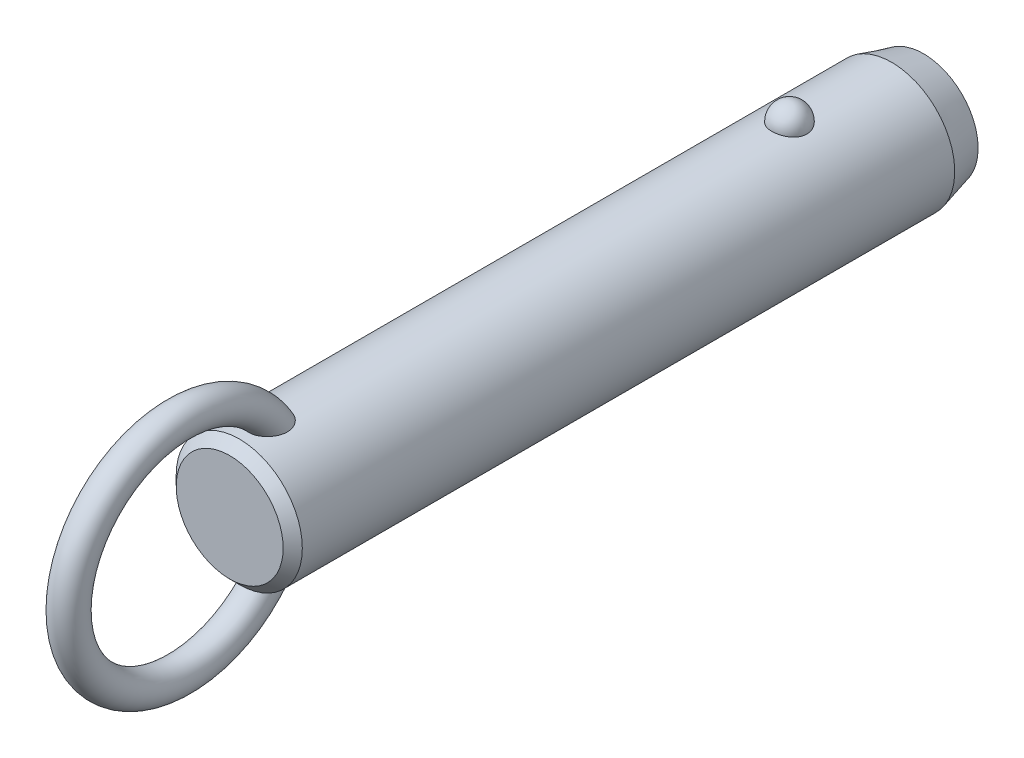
ISO-10303-21;
HEADER;
FILE_DESCRIPTION(('STEP AP214'),'2;1');
FILE_NAME('part.step','',(''),(''),'','','');
FILE_SCHEMA(('AUTOMOTIVE_DESIGN { 1 0 10303 214 1 1 1 1 }'));
ENDSEC;
DATA;
#1=APPLICATION_CONTEXT('core data for automotive mechanical design processes');
#2=APPLICATION_PROTOCOL_DEFINITION('international standard','automotive_design',2000,#1);
#3=PRODUCT_CONTEXT('',#1,'mechanical');
#4=PRODUCT('Part','Part','',(#3));
#5=PRODUCT_RELATED_PRODUCT_CATEGORY('part','',(#4));
#6=PRODUCT_DEFINITION_FORMATION('','',#4);
#7=PRODUCT_DEFINITION_CONTEXT('part definition',#1,'design');
#8=PRODUCT_DEFINITION('design','',#6,#7);
#9=PRODUCT_DEFINITION_SHAPE('','',#8);
#10=(LENGTH_UNIT() NAMED_UNIT(*) SI_UNIT(.MILLI.,.METRE.));
#11=(NAMED_UNIT(*) PLANE_ANGLE_UNIT() SI_UNIT($,.RADIAN.));
#12=(NAMED_UNIT(*) SI_UNIT($,.STERADIAN.) SOLID_ANGLE_UNIT());
#13=UNCERTAINTY_MEASURE_WITH_UNIT(LENGTH_MEASURE(1.E-05),#10,'distance_accuracy_value','');
#14=(GEOMETRIC_REPRESENTATION_CONTEXT(3) GLOBAL_UNCERTAINTY_ASSIGNED_CONTEXT((#13)) GLOBAL_UNIT_ASSIGNED_CONTEXT((#10,
#11,#12)) REPRESENTATION_CONTEXT('',''));
#15=CARTESIAN_POINT('',(0.,0.,0.));
#16=DIRECTION('',(0.,0.,1.));
#17=DIRECTION('',(1.,0.,0.));
#18=AXIS2_PLACEMENT_3D('',#15,#16,#17);
#19=CARTESIAN_POINT('',(0.,0.,58.4));
#20=DIRECTION('',(0.,0.,-1.));
#21=DIRECTION('',(-1.,0.,0.));
#22=AXIS2_PLACEMENT_3D('',#19,#20,#21);
#23=CYLINDRICAL_SURFACE('',#22,7.9);
#24=CARTESIAN_POINT('',(2.1785689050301,7.59367088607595,-2.19999999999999));
#25=CARTESIAN_POINT('',(2.17856679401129,7.59367269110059,-2.07701843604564));
#26=CARTESIAN_POINT('',(2.16853481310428,7.59657145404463,-1.95401006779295));
#27=CARTESIAN_POINT('',(2.12864689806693,7.607843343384,-1.71147811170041));
#28=CARTESIAN_POINT('',(2.09878338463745,7.61621856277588,-1.59195587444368));
#29=CARTESIAN_POINT('',(2.0199931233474,7.63749180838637,-1.3598563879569));
#30=CARTESIAN_POINT('',(1.97107475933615,7.6503878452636,-1.24727610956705));
#31=CARTESIAN_POINT('',(1.85539377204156,7.67926115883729,-1.03213234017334));
#32=CARTESIAN_POINT('',(1.78863158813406,7.69523835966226,-0.929568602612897));
#33=CARTESIAN_POINT('',(1.63856494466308,7.7285848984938,-0.736786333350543));
#34=CARTESIAN_POINT('',(1.55518140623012,7.7459606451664,-0.646630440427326));
#35=CARTESIAN_POINT('',(1.37422937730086,7.78009978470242,-0.481747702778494));
#36=CARTESIAN_POINT('',(1.27666086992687,7.79686317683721,-0.407020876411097));
#37=CARTESIAN_POINT('',(1.07024728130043,7.82786153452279,-0.275278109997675));
#38=CARTESIAN_POINT('',(0.961434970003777,7.84210353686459,-0.218212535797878));
#39=CARTESIAN_POINT('',(0.735351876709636,7.86652194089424,-0.123146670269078));
#40=CARTESIAN_POINT('',(0.618082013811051,7.87669878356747,-0.085144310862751));
#41=CARTESIAN_POINT('',(0.380637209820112,7.89170521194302,-0.0298158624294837));
#42=CARTESIAN_POINT('',(0.260550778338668,7.89662650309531,-0.0121347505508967));
#43=CARTESIAN_POINT('',(0.0190117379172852,7.90090003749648,0.00324379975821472));
#44=CARTESIAN_POINT('',(-0.102440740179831,7.90025280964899,0.00094313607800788));
#45=CARTESIAN_POINT('',(-0.341452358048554,7.89351056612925,-0.0233955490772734));
#46=CARTESIAN_POINT('',(-0.459042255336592,7.88749257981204,-0.0451545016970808));
#47=CARTESIAN_POINT('',(-0.688796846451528,7.87075812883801,-0.107408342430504));
#48=CARTESIAN_POINT('',(-0.800961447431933,7.86004158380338,-0.147903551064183));
#49=CARTESIAN_POINT('',(-1.01743634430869,7.83497131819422,-0.246799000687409));
#50=CARTESIAN_POINT('',(-1.12169791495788,7.82059709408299,-0.305300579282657));
#51=CARTESIAN_POINT('',(-1.31891765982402,7.78976470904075,-0.438549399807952));
#52=CARTESIAN_POINT('',(-1.41187469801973,7.77330633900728,-0.513298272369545));
#53=CARTESIAN_POINT('',(-1.58577142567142,7.73972434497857,-0.678622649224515));
#54=CARTESIAN_POINT('',(-1.66645140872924,7.72259402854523,-0.769470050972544));
#55=CARTESIAN_POINT('',(-1.81161503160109,7.68983776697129,-0.963538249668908));
#56=CARTESIAN_POINT('',(-1.87609753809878,7.6742119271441,-1.06675991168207));
#57=CARTESIAN_POINT('',(-1.98790138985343,7.6460202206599,-1.28401170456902));
#58=CARTESIAN_POINT('',(-2.03501994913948,7.63349104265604,-1.39815107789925));
#59=CARTESIAN_POINT('',(-2.10986724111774,7.6131449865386,-1.63301784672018));
#60=CARTESIAN_POINT('',(-2.1375965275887,7.60532797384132,-1.75374505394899));
#61=CARTESIAN_POINT('',(-2.17289256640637,7.5953195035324,-1.99782562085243));
#62=CARTESIAN_POINT('',(-2.18054294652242,7.59310471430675,-2.12116592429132));
#63=CARTESIAN_POINT('',(-2.17572919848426,7.59448538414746,-2.36741799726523));
#64=CARTESIAN_POINT('',(-2.1632656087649,7.59808068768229,-2.49032977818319));
#65=CARTESIAN_POINT('',(-2.11865035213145,7.61064035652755,-2.73161015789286));
#66=CARTESIAN_POINT('',(-2.08659579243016,7.61957823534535,-2.84999812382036));
#67=CARTESIAN_POINT('',(-2.00367799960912,7.64179982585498,-3.07955956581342));
#68=CARTESIAN_POINT('',(-1.9528140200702,7.65508371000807,-3.19073275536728));
#69=CARTESIAN_POINT('',(-1.83321113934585,7.68460381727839,-3.40337899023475));
#70=CARTESIAN_POINT('',(-1.76437735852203,7.70085556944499,-3.50479651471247));
#71=CARTESIAN_POINT('',(-1.61069526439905,7.73445734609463,-3.69446912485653));
#72=CARTESIAN_POINT('',(-1.52584634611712,7.75180741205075,-3.78272371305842));
#73=CARTESIAN_POINT('',(-1.34198059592,7.78574608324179,-3.94393987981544));
#74=CARTESIAN_POINT('',(-1.24291308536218,7.80233167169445,-4.01684434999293));
#75=CARTESIAN_POINT('',(-1.03352039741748,7.83281625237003,-4.14489386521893));
#76=CARTESIAN_POINT('',(-0.92319600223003,7.84671543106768,-4.20004014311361));
#77=CARTESIAN_POINT('',(-0.695822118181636,7.87011575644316,-4.29042017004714));
#78=CARTESIAN_POINT('',(-0.578872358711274,7.87966903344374,-4.32589112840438));
#79=CARTESIAN_POINT('',(-0.340410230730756,7.8935652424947,-4.37692226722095));
#80=CARTESIAN_POINT('',(-0.218898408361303,7.89790879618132,-4.39248482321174));
#81=CARTESIAN_POINT('',(0.0228107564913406,7.90087453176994,-4.40314405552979));
#82=CARTESIAN_POINT('',(0.142990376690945,7.89960185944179,-4.39861683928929));
#83=CARTESIAN_POINT('',(0.380829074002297,7.89171262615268,-4.37008293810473));
#84=CARTESIAN_POINT('',(0.498488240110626,7.8850962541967,-4.34607694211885));
#85=CARTESIAN_POINT('',(0.727535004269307,7.86726442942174,-4.27939317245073));
#86=CARTESIAN_POINT('',(0.838944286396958,7.85606616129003,-4.236785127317));
#87=CARTESIAN_POINT('',(1.05295421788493,7.83025654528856,-4.13408348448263));
#88=CARTESIAN_POINT('',(1.15555431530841,7.81564498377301,-4.07398879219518));
#89=CARTESIAN_POINT('',(1.35076763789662,7.7843022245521,-3.93687432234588));
#90=CARTESIAN_POINT('',(1.4432046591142,7.76754209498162,-3.85961036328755));
#91=CARTESIAN_POINT('',(1.6139111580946,7.73387857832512,-3.69076949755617));
#92=CARTESIAN_POINT('',(1.6921781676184,7.71697516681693,-3.59919010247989));
#93=CARTESIAN_POINT('',(1.83380875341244,7.6845643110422,-3.40247278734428));
#94=CARTESIAN_POINT('',(1.89689280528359,7.66908588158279,-3.29712873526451));
#95=CARTESIAN_POINT('',(2.0047823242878,7.64159441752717,-3.07707931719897));
#96=CARTESIAN_POINT('',(2.0495945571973,7.62958010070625,-2.96237743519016));
#97=CARTESIAN_POINT('',(2.11580183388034,7.61146617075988,-2.74040519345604));
#98=CARTESIAN_POINT('',(2.13929812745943,7.60484503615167,-2.63379846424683));
#99=CARTESIAN_POINT('',(2.17068242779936,7.59594664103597,-2.41813481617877));
#100=CARTESIAN_POINT('',(2.17857077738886,7.59366928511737,-2.30907795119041));
#101=CARTESIAN_POINT('',(2.1785689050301,7.59367088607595,-2.19999999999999));
#102=B_SPLINE_CURVE_WITH_KNOTS('',3,(#24,#25,#26,#27,#28,#29,#30,#31,#32,#33,#34,#35,#36,#37,
#38,#39,#40,#41,#42,#43,#44,#45,#46,#47,#48,#49,#50,#51,#52,#53,#54,#55,#56,#57,#58,#59,#60,#61,
#62,#63,#64,#65,#66,#67,#68,#69,#70,#71,#72,#73,#74,#75,#76,#77,#78,#79,#80,#81,#82,#83,#84,#85,
#86,#87,#88,#89,#90,#91,#92,#93,#94,#95,#96,#97,#98,#99,#100,#101),.UNSPECIFIED.,.T.,.F.,(4,2,2,
2,2,2,2,2,2,2,2,2,2,2,2,2,2,2,2,2,2,2,2,2,2,2,2,2,2,2,2,2,2,2,2,2,2,2,4),(0.,0.368552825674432,
0.737246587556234,1.10577831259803,1.4743009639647,1.8446206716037,2.21494081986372,
2.5842105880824,2.95344028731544,3.31611630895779,3.67875788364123,4.03628044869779,
4.39380913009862,4.75338791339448,5.11300280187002,5.47939989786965,5.8458226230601,
6.21639834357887,6.58696347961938,6.95598276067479,7.32499216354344,7.69218715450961,
8.0593967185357,8.42858578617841,8.79778880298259,9.16834203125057,9.5388695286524,
9.90482699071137,10.2707407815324,10.6298333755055,10.9889132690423,11.3466585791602,
11.7044262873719,12.0676511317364,12.4309391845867,12.8004764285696,13.1698767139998,
13.4967701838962,13.8236564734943),.UNSPECIFIED.);
#103=CARTESIAN_POINT('',(2.1785689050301,7.59367088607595,-2.19999999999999));
#104=VERTEX_POINT('',#103);
#105=EDGE_CURVE('E41',#104,#104,#102,.T.);
#106=ORIENTED_EDGE('',*,*,#105,.T.);
#107=EDGE_LOOP('',(#106));
#108=FACE_BOUND('',#107,.T.);
#109=CARTESIAN_POINT('',(0.,0.,66.72));
#110=DIRECTION('',(0.,0.,1.));
#111=DIRECTION('',(1.,0.,0.));
#112=AXIS2_PLACEMENT_3D('',#109,#110,#111);
#113=CIRCLE('',#112,7.9);
#114=CARTESIAN_POINT('',(7.9,0.,66.72));
#115=VERTEX_POINT('',#114);
#116=EDGE_CURVE('E10',#115,#115,#113,.F.);
#117=ORIENTED_EDGE('',*,*,#116,.T.);
#118=EDGE_LOOP('',(#117));
#119=FACE_BOUND('',#118,.T.);
#120=CARTESIAN_POINT('',(-0.63096985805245,-7.87476203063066,60.6124322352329));
#121=CARTESIAN_POINT('',(-0.734180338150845,-7.8664899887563,60.647285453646));
#122=CARTESIAN_POINT('',(-0.834476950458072,-7.85639291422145,60.6908160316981));
#123=CARTESIAN_POINT('',(-1.0262035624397,-7.83366343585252,60.7940948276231));
#124=CARTESIAN_POINT('',(-1.1176141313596,-7.82102565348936,60.8538775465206));
#125=CARTESIAN_POINT('',(-1.28877277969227,-7.79464922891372,60.9878390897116));
#126=CARTESIAN_POINT('',(-1.36854014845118,-7.78091246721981,61.061993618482));
#127=CARTESIAN_POINT('',(-1.5146152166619,-7.75380398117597,61.2224941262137));
#128=CARTESIAN_POINT('',(-1.58092966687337,-7.74043207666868,61.3088339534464));
#129=CARTESIAN_POINT('',(-1.70019064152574,-7.71512522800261,61.4929784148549));
#130=CARTESIAN_POINT('',(-1.75284037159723,-7.70322473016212,61.5909792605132));
#131=CARTESIAN_POINT('',(-1.84263464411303,-7.68224112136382,61.7941029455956));
#132=CARTESIAN_POINT('',(-1.87977299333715,-7.6731591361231,61.8992286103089));
#133=CARTESIAN_POINT('',(-1.94152728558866,-7.65777930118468,62.1232849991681));
#134=CARTESIAN_POINT('',(-1.96475471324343,-7.65179654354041,62.2426167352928));
#135=CARTESIAN_POINT('',(-1.99449499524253,-7.64409642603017,62.4834298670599));
#136=CARTESIAN_POINT('',(-2.0010005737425,-7.64238092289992,62.6049121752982));
#137=CARTESIAN_POINT('',(-1.99856014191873,-7.64302120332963,62.8683409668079));
#138=CARTESIAN_POINT('',(-1.98680021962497,-7.64611845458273,63.0102565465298));
#139=CARTESIAN_POINT('',(-1.94457772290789,-7.65696186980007,63.2911188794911));
#140=CARTESIAN_POINT('',(-1.91409393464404,-7.66471330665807,63.4300620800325));
#141=CARTESIAN_POINT('',(-1.82768670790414,-7.68582947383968,63.7319397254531));
#142=CARTESIAN_POINT('',(-1.76772963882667,-7.70003779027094,63.893686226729));
#143=CARTESIAN_POINT('',(-1.65998501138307,-7.72371550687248,64.1276956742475));
#144=CARTESIAN_POINT('',(-1.621079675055,-7.73200670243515,64.2042974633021));
#145=CARTESIAN_POINT('',(-1.53727726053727,-7.74910377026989,64.3540798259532));
#146=CARTESIAN_POINT('',(-1.49238215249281,-7.75790947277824,64.4272615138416));
#147=CARTESIAN_POINT('',(-1.3739705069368,-7.77993338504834,64.6028838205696));
#148=CARTESIAN_POINT('',(-1.29690364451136,-7.79328473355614,64.7029557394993));
#149=CARTESIAN_POINT('',(-1.1288548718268,-7.81939266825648,64.8907147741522));
#150=CARTESIAN_POINT('',(-1.0378992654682,-7.83215032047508,64.9784247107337));
#151=CARTESIAN_POINT('',(-0.86953281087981,-7.85231710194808,65.1134148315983));
#152=CARTESIAN_POINT('',(-0.795716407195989,-7.86021093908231,65.165076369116));
#153=CARTESIAN_POINT('',(-0.640813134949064,-7.87434920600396,65.2563815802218));
#154=CARTESIAN_POINT('',(-0.559737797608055,-7.88059619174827,65.2960438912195));
#155=CARTESIAN_POINT('',(-0.406456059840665,-7.88984116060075,65.3543008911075));
#156=CARTESIAN_POINT('',(-0.3352279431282,-7.89321892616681,65.3753848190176));
#157=CARTESIAN_POINT('',(-0.190193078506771,-7.89804235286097,65.4054141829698));
#158=CARTESIAN_POINT('',(-0.116388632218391,-7.89948969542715,65.4143701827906));
#159=CARTESIAN_POINT('',(0.0318414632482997,-7.90028409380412,65.4192915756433));
#160=CARTESIAN_POINT('',(0.106268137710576,-7.89962640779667,65.4152276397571));
#161=CARTESIAN_POINT('',(0.253290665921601,-7.8962818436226,65.3944615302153));
#162=CARTESIAN_POINT('',(0.32588518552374,-7.8935935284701,65.3777504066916));
#163=CARTESIAN_POINT('',(0.481441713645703,-7.88577340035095,65.3287380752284));
#164=CARTESIAN_POINT('',(0.563611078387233,-7.88026321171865,65.294005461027));
#165=CARTESIAN_POINT('',(0.721129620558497,-7.86741729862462,65.2117965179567));
#166=CARTESIAN_POINT('',(0.796466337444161,-7.86007832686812,65.1642975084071));
#167=CARTESIAN_POINT('',(0.971456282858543,-7.84073285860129,65.036513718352));
#168=CARTESIAN_POINT('',(1.06719686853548,-7.82809461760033,64.9510047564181));
#169=CARTESIAN_POINT('',(1.24418921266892,-7.80192439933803,64.766232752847));
#170=CARTESIAN_POINT('',(1.32540832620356,-7.78839049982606,64.6669395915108));
#171=CARTESIAN_POINT('',(1.45199971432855,-7.76559693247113,64.4895760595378));
#172=CARTESIAN_POINT('',(1.50085649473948,-7.75626094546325,64.4139542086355));
#173=CARTESIAN_POINT('',(1.59197749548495,-7.73807279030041,64.2587428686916));
#174=CARTESIAN_POINT('',(1.63423919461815,-7.72922080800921,64.179151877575));
#175=CARTESIAN_POINT('',(1.7122261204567,-7.71231959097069,64.0166640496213));
#176=CARTESIAN_POINT('',(1.74794516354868,-7.70427111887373,63.933764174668));
#177=CARTESIAN_POINT('',(1.81270113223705,-7.68929240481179,63.7652967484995));
#178=CARTESIAN_POINT('',(1.84173789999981,-7.68236218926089,63.6797291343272));
#179=CARTESIAN_POINT('',(1.89322698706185,-7.6698375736,63.5052870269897));
#180=CARTESIAN_POINT('',(1.91558744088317,-7.66426199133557,63.4163838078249));
#181=CARTESIAN_POINT('',(1.9528136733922,-7.65485915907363,63.2369696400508));
#182=CARTESIAN_POINT('',(1.96767946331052,-7.65103190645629,63.1464586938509));
#183=CARTESIAN_POINT('',(2.0002145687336,-7.64262981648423,62.8737320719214));
#184=CARTESIAN_POINT('',(2.00600691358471,-7.6410871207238,62.6897099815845));
#185=CARTESIAN_POINT('',(1.98445334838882,-7.64669564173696,62.3765019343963));
#186=CARTESIAN_POINT('',(1.96607186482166,-7.65149688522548,62.246618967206));
#187=CARTESIAN_POINT('',(1.90884967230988,-7.66597624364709,61.9916321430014));
#188=CARTESIAN_POINT('',(1.87002101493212,-7.67565148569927,61.866525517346));
#189=CARTESIAN_POINT('',(1.77063986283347,-7.69918471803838,61.6245401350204));
#190=CARTESIAN_POINT('',(1.70993724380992,-7.71307150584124,61.5077250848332));
#191=CARTESIAN_POINT('',(1.56733070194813,-7.74330306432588,61.2881444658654));
#192=CARTESIAN_POINT('',(1.48543692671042,-7.75964665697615,61.1853722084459));
#193=CARTESIAN_POINT('',(1.31346177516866,-7.79047523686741,61.0093800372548));
#194=CARTESIAN_POINT('',(1.22547278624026,-7.80495298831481,60.9341066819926));
#195=CARTESIAN_POINT('',(1.0372435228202,-7.83218597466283,60.8004864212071));
#196=CARTESIAN_POINT('',(0.937008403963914,-7.84494192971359,60.7421324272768));
#197=CARTESIAN_POINT('',(0.733599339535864,-7.86649045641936,60.6470270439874));
#198=CARTESIAN_POINT('',(0.630941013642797,-7.87547134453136,60.6092109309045));
#199=CARTESIAN_POINT('',(0.420465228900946,-7.88950708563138,60.5511160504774));
#200=CARTESIAN_POINT('',(0.31264590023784,-7.89456050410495,60.5308436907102));
#201=CARTESIAN_POINT('',(0.096086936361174,-7.9001518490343,60.5084559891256));
#202=CARTESIAN_POINT('',(-0.0126341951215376,-7.90073226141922,60.5061698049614));
#203=CARTESIAN_POINT('',(-0.228766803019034,-7.89742350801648,60.5193678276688));
#204=CARTESIAN_POINT('',(-0.336180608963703,-7.89354403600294,60.5348134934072));
#205=CARTESIAN_POINT('',(-0.473410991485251,-7.88586871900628,60.5662177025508));
#206=CARTESIAN_POINT('',(-0.505257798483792,-7.88388984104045,60.5743541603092));
#207=CARTESIAN_POINT('',(-0.568481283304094,-7.87958326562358,60.5922083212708));
#208=CARTESIAN_POINT('',(-0.59985795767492,-7.87725556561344,60.6019260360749));
#209=CARTESIAN_POINT('',(-0.63096985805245,-7.87476203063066,60.6124322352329));
#210=B_SPLINE_CURVE_WITH_KNOTS('',3,(#120,#121,#122,#123,#124,#125,#126,#127,#128,#129,#130,
#131,#132,#133,#134,#135,#136,#137,#138,#139,#140,#141,#142,#143,#144,#145,#146,#147,#148,#149,
#150,#151,#152,#153,#154,#155,#156,#157,#158,#159,#160,#161,#162,#163,#164,#165,#166,#167,#168,
#169,#170,#171,#172,#173,#174,#175,#176,#177,#178,#179,#180,#181,#182,#183,#184,#185,#186,#187,
#188,#189,#190,#191,#192,#193,#194,#195,#196,#197,#198,#199,#200,#201,#202,#203,#204,#205,#206,
#207,#208,#209),.UNSPECIFIED.,.T.,.F.,(4,2,2,2,2,2,2,2,2,2,2,2,2,2,2,2,2,2,2,2,2,2,2,2,2,2,2,2,
2,2,2,2,2,2,2,2,2,2,2,2,2,2,2,2,4),(0.,0.327622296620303,0.65594559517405,0.983718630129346,
1.3113267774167,1.64554655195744,1.97989964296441,2.3436572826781,2.70757317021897,
3.13333684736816,3.55958380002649,4.07655306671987,4.33527897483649,4.59391999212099,
4.97382437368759,5.35301797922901,5.62348245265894,5.89352465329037,6.11565959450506,
6.33760092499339,6.56004255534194,6.78264174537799,7.04930844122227,7.31645206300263,
7.70130871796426,8.08701995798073,8.35824509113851,8.62957365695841,8.90115735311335,
9.17274746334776,9.44791855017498,9.72308922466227,10.2715298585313,10.6638393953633,
11.0559179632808,11.4507403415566,11.8453740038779,12.1936425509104,12.5417649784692,
12.8695063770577,13.1973674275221,13.5221104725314,13.8461490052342,13.9449071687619,
14.0436660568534),.UNSPECIFIED.);
#211=CARTESIAN_POINT('',(-0.63096985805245,-7.87476203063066,60.6124322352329));
#212=VERTEX_POINT('',#211);
#213=EDGE_CURVE('E60',#212,#212,#210,.T.);
#214=ORIENTED_EDGE('',*,*,#213,.T.);
#215=EDGE_LOOP('',(#214));
#216=FACE_BOUND('',#215,.T.);
#217=CARTESIAN_POINT('',(-0.63096985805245,7.87476203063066,60.6124322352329));
#218=CARTESIAN_POINT('',(-0.528918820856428,7.88293636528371,60.5779798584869));
#219=CARTESIAN_POINT('',(-0.423745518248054,7.88934810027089,60.551915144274));
#220=CARTESIAN_POINT('',(-0.210236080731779,7.8979273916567,60.5172825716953));
#221=CARTESIAN_POINT('',(-0.101893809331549,7.90008607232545,60.5087513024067));
#222=CARTESIAN_POINT('',(0.114660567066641,7.89990877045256,60.5094570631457));
#223=CARTESIAN_POINT('',(0.222872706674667,7.89757640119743,60.5186798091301));
#224=CARTESIAN_POINT('',(0.436107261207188,7.88867538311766,60.5546525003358));
#225=CARTESIAN_POINT('',(0.541131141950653,7.8821087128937,60.5813942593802));
#226=CARTESIAN_POINT('',(0.74508556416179,7.86545130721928,60.6517561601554));
#227=CARTESIAN_POINT('',(0.844015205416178,7.85536005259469,60.6953787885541));
#228=CARTESIAN_POINT('',(1.03299167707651,7.83275153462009,60.7983796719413));
#229=CARTESIAN_POINT('',(1.12303841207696,7.8202342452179,60.8577580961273));
#230=CARTESIAN_POINT('',(1.29214734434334,7.79408219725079,60.9908647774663));
#231=CARTESIAN_POINT('',(1.37116907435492,7.78044359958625,61.0646436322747));
#232=CARTESIAN_POINT('',(1.51597677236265,7.75353170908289,61.2242353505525));
#233=CARTESIAN_POINT('',(1.58176261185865,7.74025841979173,61.3100483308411));
#234=CARTESIAN_POINT('',(1.70057386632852,7.71504069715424,61.493644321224));
#235=CARTESIAN_POINT('',(1.75320073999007,7.7031425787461,61.5916906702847));
#236=CARTESIAN_POINT('',(1.8429376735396,7.68216822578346,61.7948931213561));
#237=CARTESIAN_POINT('',(1.88004278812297,7.67309289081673,61.9000514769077));
#238=CARTESIAN_POINT('',(1.94172327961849,7.6577294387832,62.1241671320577));
#239=CARTESIAN_POINT('',(1.96491037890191,7.65175648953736,62.2435248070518));
#240=CARTESIAN_POINT('',(1.9945689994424,7.64407702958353,62.4843848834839));
#241=CARTESIAN_POINT('',(2.00103304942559,7.64237242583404,62.6058882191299));
#242=CARTESIAN_POINT('',(1.99850166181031,7.64303650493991,62.8693688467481));
#243=CARTESIAN_POINT('',(1.98669038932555,7.64614714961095,63.0113141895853));
#244=CARTESIAN_POINT('',(1.94436120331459,7.6570170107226,63.2922287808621));
#245=CARTESIAN_POINT('',(1.91382203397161,7.66478150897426,63.4311944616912));
#246=CARTESIAN_POINT('',(1.82728754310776,7.68592483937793,63.7331110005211));
#247=CARTESIAN_POINT('',(1.76725778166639,7.7001468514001,63.894872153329));
#248=CARTESIAN_POINT('',(1.65939700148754,7.72384204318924,64.1288914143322));
#249=CARTESIAN_POINT('',(1.62045187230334,7.73213852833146,64.2054942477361));
#250=CARTESIAN_POINT('',(1.53656684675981,7.74924489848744,64.3552737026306));
#251=CARTESIAN_POINT('',(1.49162892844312,7.75805461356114,64.4284514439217));
#252=CARTESIAN_POINT('',(1.37317698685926,7.78007342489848,64.6039520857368));
#253=CARTESIAN_POINT('',(1.29612360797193,7.79341423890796,64.7039112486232));
#254=CARTESIAN_POINT('',(1.12812043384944,7.81949839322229,64.8914508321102));
#255=CARTESIAN_POINT('',(1.03719688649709,7.83224280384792,64.9790540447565));
#256=CARTESIAN_POINT('',(0.868871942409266,7.85239026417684,65.1138971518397));
#257=CARTESIAN_POINT('',(0.795056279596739,7.86027769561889,65.1655113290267));
#258=CARTESIAN_POINT('',(0.64016072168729,7.87440222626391,65.2567201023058));
#259=CARTESIAN_POINT('',(0.559092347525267,7.88064188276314,65.2963333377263));
#260=CARTESIAN_POINT('',(0.405820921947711,7.8898738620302,65.3545056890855));
#261=CARTESIAN_POINT('',(0.334594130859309,7.89324577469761,65.3755523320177));
#262=CARTESIAN_POINT('',(0.189568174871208,7.89805733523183,65.4055070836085));
#263=CARTESIAN_POINT('',(0.115771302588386,7.89949866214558,65.4144257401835));
#264=CARTESIAN_POINT('',(-0.0324359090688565,7.90028156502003,65.4192758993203));
#265=CARTESIAN_POINT('',(-0.106847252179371,7.89961843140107,65.4151782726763));
#266=CARTESIAN_POINT('',(-0.253834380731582,7.8962642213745,65.3943519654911));
#267=CARTESIAN_POINT('',(-0.32640882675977,7.89357170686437,65.3776143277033));
#268=CARTESIAN_POINT('',(-0.481962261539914,7.88574179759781,65.3285391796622));
#269=CARTESIAN_POINT('',(-0.564145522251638,7.88022507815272,65.2937638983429));
#270=CARTESIAN_POINT('',(-0.721685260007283,7.86736646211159,65.2114686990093));
#271=CARTESIAN_POINT('',(-0.797029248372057,7.8600213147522,65.1639260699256));
#272=CARTESIAN_POINT('',(-0.972044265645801,7.84066026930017,65.0360267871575));
#273=CARTESIAN_POINT('',(-1.06779803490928,7.828012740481,64.9504436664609));
#274=CARTESIAN_POINT('',(-1.24480531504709,7.80182621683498,64.7655223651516));
#275=CARTESIAN_POINT('',(-1.3260261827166,7.78828530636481,64.6661540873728));
#276=CARTESIAN_POINT('',(-1.45259834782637,7.76548487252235,64.4886806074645));
#277=CARTESIAN_POINT('',(-1.50143856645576,7.75614818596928,64.4130252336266));
#278=CARTESIAN_POINT('',(-1.59252410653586,7.73796020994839,64.2577484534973));
#279=CARTESIAN_POINT('',(-1.63476690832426,7.72910910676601,64.1781255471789));
#280=CARTESIAN_POINT('',(-1.71271318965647,7.71221133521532,64.0155750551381));
#281=CARTESIAN_POINT('',(-1.7484104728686,7.70416543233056,63.9326444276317));
#282=CARTESIAN_POINT('',(-1.81311929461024,7.6891937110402,63.7641168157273));
#283=CARTESIAN_POINT('',(-1.84213067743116,7.6822679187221,63.6785197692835));
#284=CARTESIAN_POINT('',(-1.89356259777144,7.66975461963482,63.5040254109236));
#285=CARTESIAN_POINT('',(-1.91589165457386,7.66418586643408,63.4150995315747));
#286=CARTESIAN_POINT('',(-1.95305070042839,7.65479859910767,63.2356424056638));
#287=CARTESIAN_POINT('',(-1.96788069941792,7.65098008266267,63.1451111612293));
#288=CARTESIAN_POINT('',(-2.00030078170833,7.64260704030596,62.8723270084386));
#289=CARTESIAN_POINT('',(-2.00600576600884,7.64108760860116,62.6882718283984));
#290=CARTESIAN_POINT('',(-1.98428483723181,7.64673945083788,62.3750800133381));
#291=CARTESIAN_POINT('',(-1.96583698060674,7.6515575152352,62.2452400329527));
#292=CARTESIAN_POINT('',(-1.90848948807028,7.66606613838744,61.9903619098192));
#293=CARTESIAN_POINT('',(-1.86960376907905,7.67575338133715,61.865320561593));
#294=CARTESIAN_POINT('',(-1.77013421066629,7.6993013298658,61.6235009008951));
#295=CARTESIAN_POINT('',(-1.70940488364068,7.71318991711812,61.5067844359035));
#296=CARTESIAN_POINT('',(-1.56672953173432,7.74342495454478,61.2873404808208));
#297=CARTESIAN_POINT('',(-1.48478316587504,7.75977144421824,61.1846132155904));
#298=CARTESIAN_POINT('',(-1.31266325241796,7.79061163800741,61.008643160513));
#299=CARTESIAN_POINT('',(-1.22456383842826,7.80509908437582,60.9333589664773));
#300=CARTESIAN_POINT('',(-1.03622400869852,7.83231881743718,60.7998659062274));
#301=CARTESIAN_POINT('',(-0.936015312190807,7.84505551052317,60.7416137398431));
#302=CARTESIAN_POINT('',(-0.798824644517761,7.85957802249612,60.6775408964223));
#303=CARTESIAN_POINT('',(-0.765787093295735,7.86286821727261,60.6632248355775));
#304=CARTESIAN_POINT('',(-0.69893958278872,7.86909211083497,60.636436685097));
#305=CARTESIAN_POINT('',(-0.66512963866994,7.8720258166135,60.6239645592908));
#306=CARTESIAN_POINT('',(-0.63096985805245,7.87476203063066,60.6124322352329));
#307=B_SPLINE_CURVE_WITH_KNOTS('',3,(#217,#218,#219,#220,#221,#222,#223,#224,#225,#226,#227,
#228,#229,#230,#231,#232,#233,#234,#235,#236,#237,#238,#239,#240,#241,#242,#243,#244,#245,#246,
#247,#248,#249,#250,#251,#252,#253,#254,#255,#256,#257,#258,#259,#260,#261,#262,#263,#264,#265,
#266,#267,#268,#269,#270,#271,#272,#273,#274,#275,#276,#277,#278,#279,#280,#281,#282,#283,#284,
#285,#286,#287,#288,#289,#290,#291,#292,#293,#294,#295,#296,#297,#298,#299,#300,#301,#302,#303,
#304,#305,#306),.UNSPECIFIED.,.T.,.F.,(4,2,2,2,2,2,2,2,2,2,2,2,2,2,2,2,2,2,2,2,2,2,2,2,2,2,2,2,
2,2,2,2,2,2,2,2,2,2,2,2,2,2,2,2,4),(0.,0.323920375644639,0.648516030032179,0.972850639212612,
1.29703380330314,1.62126473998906,1.94549915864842,2.27089401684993,2.59629203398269,
2.93059633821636,3.26500707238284,3.62881644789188,3.99278833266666,4.41865421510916,
4.84500434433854,5.36209210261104,5.62087589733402,5.87957448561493,6.25918598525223,
6.63808782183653,6.90846748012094,7.17842501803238,7.40052350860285,7.62242871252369,
7.84483086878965,8.0673907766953,8.33414615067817,8.60137921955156,8.98641454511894,
9.37230415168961,9.64358673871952,9.91497268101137,10.1866142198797,10.4582620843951,
10.7334745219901,11.008686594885,11.5572126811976,11.9494246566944,12.3413699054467,
12.7359755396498,13.1305875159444,13.4791770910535,13.82687259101,13.9353013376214,
14.0437279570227),.UNSPECIFIED.);
#308=CARTESIAN_POINT('',(-0.63096985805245,7.87476203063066,60.6124322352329));
#309=VERTEX_POINT('',#308);
#310=EDGE_CURVE('E68',#309,#309,#307,.T.);
#311=ORIENTED_EDGE('',*,*,#310,.T.);
#312=EDGE_LOOP('',(#311));
#313=FACE_BOUND('',#312,.T.);
#314=CARTESIAN_POINT('',(0.,0.,-15.));
#315=DIRECTION('',(0.,0.,-1.));
#316=DIRECTION('',(-1.,0.,0.));
#317=AXIS2_PLACEMENT_3D('',#314,#315,#316);
#318=CIRCLE('',#317,7.9);
#319=CARTESIAN_POINT('',(-7.9,0.,-15.));
#320=VERTEX_POINT('',#319);
#321=EDGE_CURVE('E57',#320,#320,#318,.F.);
#322=ORIENTED_EDGE('',*,*,#321,.T.);
#323=EDGE_LOOP('',(#322));
#324=FACE_BOUND('',#323,.T.);
#325=ADVANCED_FACE('F37',(#108,#119,#216,#313,#324),#23,.T.);
#326=CARTESIAN_POINT('',(0.,0.,-19.));
#327=DIRECTION('',(0.,0.,-1.));
#328=DIRECTION('',(-1.,0.,0.));
#329=AXIS2_PLACEMENT_3D('',#326,#327,#328);
#330=PLANE('',#329);
#331=CARTESIAN_POINT('',(0.,0.,-19.));
#332=DIRECTION('',(0.,0.,-1.));
#333=DIRECTION('',(-1.,0.,0.));
#334=AXIS2_PLACEMENT_3D('',#331,#332,#333);
#335=CIRCLE('',#334,6.82820323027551);
#336=CARTESIAN_POINT('',(-6.82820323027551,0.,-19.));
#337=VERTEX_POINT('',#336);
#338=EDGE_CURVE('E67',#337,#337,#335,.T.);
#339=ORIENTED_EDGE('',*,*,#338,.T.);
#340=EDGE_LOOP('',(#339));
#341=FACE_BOUND('',#340,.T.);
#342=ADVANCED_FACE('F86',(#341),#330,.T.);
#343=CARTESIAN_POINT('',(0.,0.,-19.));
#344=DIRECTION('',(0.,0.,1.));
#345=DIRECTION('',(1.,0.,0.));
#346=AXIS2_PLACEMENT_3D('',#343,#344,#345);
#347=CONICAL_SURFACE('',#346,6.82820323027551,0.261799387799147);
#348=ORIENTED_EDGE('',*,*,#321,.F.);
#349=EDGE_LOOP('',(#348));
#350=FACE_BOUND('',#349,.T.);
#351=ORIENTED_EDGE('',*,*,#338,.F.);
#352=EDGE_LOOP('',(#351));
#353=FACE_BOUND('',#352,.T.);
#354=ADVANCED_FACE('F84',(#350,#353),#347,.T.);
#355=CARTESIAN_POINT('',(0.,0.,67.92));
#356=DIRECTION('',(0.,0.,1.));
#357=DIRECTION('',(1.,0.,0.));
#358=AXIS2_PLACEMENT_3D('',#355,#356,#357);
#359=PLANE('',#358);
#360=CARTESIAN_POINT('',(0.,0.,67.92));
#361=DIRECTION('',(0.,0.,1.));
#362=DIRECTION('',(1.,0.,0.));
#363=AXIS2_PLACEMENT_3D('',#360,#361,#362);
#364=CIRCLE('',#363,6.70000000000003);
#365=CARTESIAN_POINT('',(6.70000000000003,0.,67.92));
#366=VERTEX_POINT('',#365);
#367=EDGE_CURVE('E50',#366,#366,#364,.T.);
#368=ORIENTED_EDGE('',*,*,#367,.T.);
#369=EDGE_LOOP('',(#368));
#370=FACE_BOUND('',#369,.T.);
#371=ADVANCED_FACE('F78',(#370),#359,.T.);
#372=CARTESIAN_POINT('',(0.,0.,74.25));
#373=DIRECTION('',(1.,0.,0.));
#374=DIRECTION('',(0.,0.,-1.));
#375=AXIS2_PLACEMENT_3D('',#372,#373,#374);
#376=TOROIDAL_SURFACE('',#375,13.85,2.);
#377=ORIENTED_EDGE('',*,*,#310,.F.);
#378=EDGE_LOOP('',(#377));
#379=FACE_BOUND('',#378,.T.);
#380=ORIENTED_EDGE('',*,*,#213,.F.);
#381=EDGE_LOOP('',(#380));
#382=FACE_BOUND('',#381,.T.);
#383=ADVANCED_FACE('F74',(#379,#382),#376,.T.);
#384=CARTESIAN_POINT('',(0.,0.,67.92));
#385=DIRECTION('',(0.,0.,-1.));
#386=DIRECTION('',(-1.,0.,0.));
#387=AXIS2_PLACEMENT_3D('',#384,#385,#386);
#388=CONICAL_SURFACE('',#387,6.70000000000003,0.785398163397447);
#389=ORIENTED_EDGE('',*,*,#116,.F.);
#390=EDGE_LOOP('',(#389));
#391=FACE_BOUND('',#390,.T.);
#392=ORIENTED_EDGE('',*,*,#367,.F.);
#393=EDGE_LOOP('',(#392));
#394=FACE_BOUND('',#393,.T.);
#395=ADVANCED_FACE('F39',(#391,#394),#388,.T.);
#396=CARTESIAN_POINT('',(0.,7.9,-2.19999999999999));
#397=DIRECTION('',(0.,1.,0.));
#398=DIRECTION('',(0.,0.,-1.));
#399=AXIS2_PLACEMENT_3D('',#396,#397,#398);
#400=SPHERICAL_SURFACE('',#399,2.2);
#401=ORIENTED_EDGE('',*,*,#105,.F.);
#402=EDGE_LOOP('',(#401));
#403=FACE_BOUND('',#402,.T.);
#404=ADVANCED_FACE('F80',(#403),#400,.T.);
#405=CLOSED_SHELL('',(#325,#342,#354,#371,#383,#395,#404));
#406=MANIFOLD_SOLID_BREP('B2',#405);
#407=ADVANCED_BREP_SHAPE_REPRESENTATION('',(#18,#406),#14);
#408=SHAPE_DEFINITION_REPRESENTATION(#9,#407);
ENDSEC;
END-ISO-10303-21;
